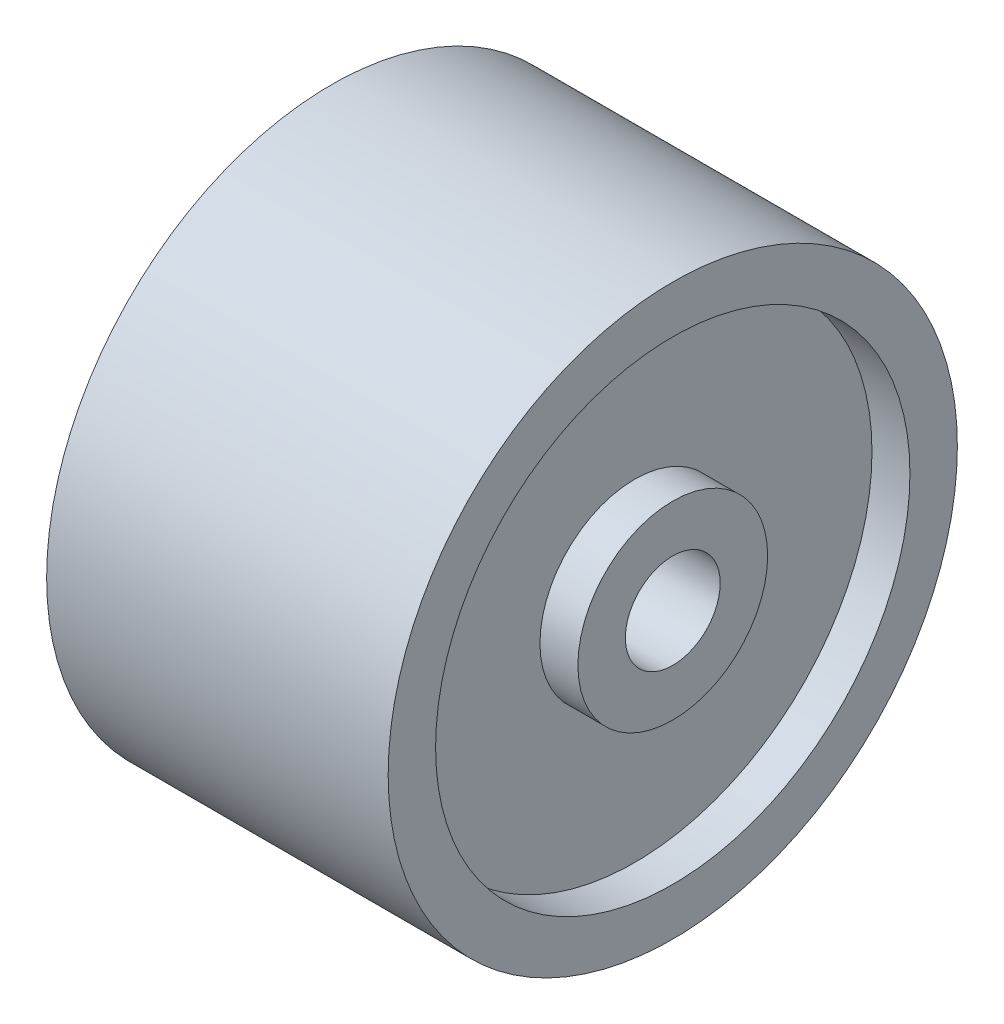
ISO-10303-21;
HEADER;
FILE_DESCRIPTION(('STEP AP214'),'2;1');
FILE_NAME('part.step','',(''),(''),'','','');
FILE_SCHEMA(('AUTOMOTIVE_DESIGN { 1 0 10303 214 1 1 1 1 }'));
ENDSEC;
DATA;
#1=APPLICATION_CONTEXT('core data for automotive mechanical design processes');
#2=APPLICATION_PROTOCOL_DEFINITION('international standard','automotive_design',2000,#1);
#3=PRODUCT_CONTEXT('',#1,'mechanical');
#4=PRODUCT('Part','Part','',(#3));
#5=PRODUCT_RELATED_PRODUCT_CATEGORY('part','',(#4));
#6=PRODUCT_DEFINITION_FORMATION('','',#4);
#7=PRODUCT_DEFINITION_CONTEXT('part definition',#1,'design');
#8=PRODUCT_DEFINITION('design','',#6,#7);
#9=PRODUCT_DEFINITION_SHAPE('','',#8);
#10=(LENGTH_UNIT() NAMED_UNIT(*) SI_UNIT(.MILLI.,.METRE.));
#11=(NAMED_UNIT(*) PLANE_ANGLE_UNIT() SI_UNIT($,.RADIAN.));
#12=(NAMED_UNIT(*) SI_UNIT($,.STERADIAN.) SOLID_ANGLE_UNIT());
#13=UNCERTAINTY_MEASURE_WITH_UNIT(LENGTH_MEASURE(1.E-05),#10,'distance_accuracy_value','');
#14=(GEOMETRIC_REPRESENTATION_CONTEXT(3) GLOBAL_UNCERTAINTY_ASSIGNED_CONTEXT((#13)) GLOBAL_UNIT_ASSIGNED_CONTEXT((#10,
#11,#12)) REPRESENTATION_CONTEXT('',''));
#15=CARTESIAN_POINT('',(0.,0.,0.));
#16=DIRECTION('',(0.,0.,1.));
#17=DIRECTION('',(1.,0.,0.));
#18=AXIS2_PLACEMENT_3D('',#15,#16,#17);
#19=CARTESIAN_POINT('',(-11.43,0.,0.));
#20=DIRECTION('',(1.,0.,0.));
#21=DIRECTION('',(0.,0.,-1.));
#22=AXIS2_PLACEMENT_3D('',#19,#20,#21);
#23=PLANE('',#22);
#24=CARTESIAN_POINT('',(-11.43,0.,0.));
#25=DIRECTION('',(1.,0.,0.));
#26=DIRECTION('',(0.,0.,-1.));
#27=AXIS2_PLACEMENT_3D('',#24,#25,#26);
#28=CIRCLE('',#27,19.05);
#29=CARTESIAN_POINT('',(-11.43,0.,-19.05));
#30=VERTEX_POINT('',#29);
#31=EDGE_CURVE('E34',#30,#30,#28,.T.);
#32=ORIENTED_EDGE('',*,*,#31,.F.);
#33=EDGE_LOOP('',(#32));
#34=FACE_BOUND('',#33,.T.);
#35=CARTESIAN_POINT('',(-11.43,0.,0.));
#36=DIRECTION('',(1.,0.,0.));
#37=DIRECTION('',(0.,0.,-1.));
#38=AXIS2_PLACEMENT_3D('',#35,#36,#37);
#39=CIRCLE('',#38,15.875);
#40=CARTESIAN_POINT('',(-11.43,0.,-15.875));
#41=VERTEX_POINT('',#40);
#42=EDGE_CURVE('E61',#41,#41,#39,.T.);
#43=ORIENTED_EDGE('',*,*,#42,.T.);
#44=EDGE_LOOP('',(#43));
#45=FACE_BOUND('',#44,.T.);
#46=ADVANCED_FACE('F30',(#34,#45),#23,.F.);
#47=CARTESIAN_POINT('',(11.43,0.,0.));
#48=DIRECTION('',(1.,0.,0.));
#49=DIRECTION('',(0.,0.,-1.));
#50=AXIS2_PLACEMENT_3D('',#47,#48,#49);
#51=PLANE('',#50);
#52=CARTESIAN_POINT('',(11.43,0.,0.));
#53=DIRECTION('',(1.,0.,0.));
#54=DIRECTION('',(0.,0.,-1.));
#55=AXIS2_PLACEMENT_3D('',#52,#53,#54);
#56=CIRCLE('',#55,3.175);
#57=CARTESIAN_POINT('',(11.43,0.,-3.175));
#58=VERTEX_POINT('',#57);
#59=EDGE_CURVE('E41',#58,#58,#56,.T.);
#60=ORIENTED_EDGE('',*,*,#59,.F.);
#61=EDGE_LOOP('',(#60));
#62=FACE_BOUND('',#61,.T.);
#63=CARTESIAN_POINT('',(11.43,0.,0.));
#64=DIRECTION('',(1.,0.,0.));
#65=DIRECTION('',(0.,0.,-1.));
#66=AXIS2_PLACEMENT_3D('',#63,#64,#65);
#67=CIRCLE('',#66,6.35);
#68=CARTESIAN_POINT('',(11.43,0.,-6.35));
#69=VERTEX_POINT('',#68);
#70=EDGE_CURVE('E55',#69,#69,#67,.T.);
#71=ORIENTED_EDGE('',*,*,#70,.T.);
#72=EDGE_LOOP('',(#71));
#73=FACE_BOUND('',#72,.T.);
#74=ADVANCED_FACE('F103',(#62,#73),#51,.T.);
#75=CARTESIAN_POINT('',(11.43,0.,0.));
#76=DIRECTION('',(1.,0.,0.));
#77=DIRECTION('',(0.,0.,-1.));
#78=AXIS2_PLACEMENT_3D('',#75,#76,#77);
#79=CIRCLE('',#78,15.875);
#80=CARTESIAN_POINT('',(11.43,0.,-15.875));
#81=VERTEX_POINT('',#80);
#82=EDGE_CURVE('E49',#81,#81,#79,.T.);
#83=ORIENTED_EDGE('',*,*,#82,.F.);
#84=EDGE_LOOP('',(#83));
#85=FACE_BOUND('',#84,.T.);
#86=CARTESIAN_POINT('',(11.43,0.,0.));
#87=DIRECTION('',(1.,0.,0.));
#88=DIRECTION('',(0.,0.,-1.));
#89=AXIS2_PLACEMENT_3D('',#86,#87,#88);
#90=CIRCLE('',#89,19.05);
#91=CARTESIAN_POINT('',(11.43,0.,-19.05));
#92=VERTEX_POINT('',#91);
#93=EDGE_CURVE('E10',#92,#92,#90,.T.);
#94=ORIENTED_EDGE('',*,*,#93,.T.);
#95=EDGE_LOOP('',(#94));
#96=FACE_BOUND('',#95,.T.);
#97=ADVANCED_FACE('F85',(#85,#96),#51,.T.);
#98=CARTESIAN_POINT('',(-11.43,0.,0.));
#99=DIRECTION('',(1.,0.,0.));
#100=DIRECTION('',(0.,0.,-1.));
#101=AXIS2_PLACEMENT_3D('',#98,#99,#100);
#102=CIRCLE('',#101,6.35);
#103=CARTESIAN_POINT('',(-11.43,0.,-6.35));
#104=VERTEX_POINT('',#103);
#105=EDGE_CURVE('E67',#104,#104,#102,.T.);
#106=ORIENTED_EDGE('',*,*,#105,.F.);
#107=EDGE_LOOP('',(#106));
#108=FACE_BOUND('',#107,.T.);
#109=CARTESIAN_POINT('',(-11.43,0.,0.));
#110=DIRECTION('',(1.,0.,0.));
#111=DIRECTION('',(0.,0.,-1.));
#112=AXIS2_PLACEMENT_3D('',#109,#110,#111);
#113=CIRCLE('',#112,3.175);
#114=CARTESIAN_POINT('',(-11.43,0.,-3.175));
#115=VERTEX_POINT('',#114);
#116=EDGE_CURVE('E43',#115,#115,#113,.T.);
#117=ORIENTED_EDGE('',*,*,#116,.T.);
#118=EDGE_LOOP('',(#117));
#119=FACE_BOUND('',#118,.T.);
#120=ADVANCED_FACE('F82',(#108,#119),#23,.F.);
#121=CARTESIAN_POINT('',(11.43,0.,0.));
#122=DIRECTION('',(-1.,0.,0.));
#123=DIRECTION('',(0.,0.,1.));
#124=AXIS2_PLACEMENT_3D('',#121,#122,#123);
#125=CYLINDRICAL_SURFACE('',#124,19.05);
#126=ORIENTED_EDGE('',*,*,#93,.F.);
#127=EDGE_LOOP('',(#126));
#128=FACE_BOUND('',#127,.T.);
#129=ORIENTED_EDGE('',*,*,#31,.T.);
#130=EDGE_LOOP('',(#129));
#131=FACE_BOUND('',#130,.T.);
#132=ADVANCED_FACE('F32',(#128,#131),#125,.T.);
#133=CARTESIAN_POINT('',(11.43,0.,0.));
#134=DIRECTION('',(-1.,0.,0.));
#135=DIRECTION('',(0.,0.,1.));
#136=AXIS2_PLACEMENT_3D('',#133,#134,#135);
#137=CYLINDRICAL_SURFACE('',#136,3.175);
#138=ORIENTED_EDGE('',*,*,#59,.T.);
#139=EDGE_LOOP('',(#138));
#140=FACE_BOUND('',#139,.T.);
#141=ORIENTED_EDGE('',*,*,#116,.F.);
#142=EDGE_LOOP('',(#141));
#143=FACE_BOUND('',#142,.T.);
#144=ADVANCED_FACE('F88',(#140,#143),#137,.F.);
#145=CARTESIAN_POINT('',(8.89,0.,0.));
#146=DIRECTION('',(1.,0.,0.));
#147=DIRECTION('',(0.,0.,-1.));
#148=AXIS2_PLACEMENT_3D('',#145,#146,#147);
#149=CYLINDRICAL_SURFACE('',#148,15.875);
#150=CARTESIAN_POINT('',(8.89,0.,0.));
#151=DIRECTION('',(1.,0.,0.));
#152=DIRECTION('',(0.,0.,-1.));
#153=AXIS2_PLACEMENT_3D('',#150,#151,#152);
#154=CIRCLE('',#153,15.875);
#155=CARTESIAN_POINT('',(8.89,0.,-15.875));
#156=VERTEX_POINT('',#155);
#157=EDGE_CURVE('E46',#156,#156,#154,.T.);
#158=ORIENTED_EDGE('',*,*,#157,.F.);
#159=EDGE_LOOP('',(#158));
#160=FACE_BOUND('',#159,.T.);
#161=ORIENTED_EDGE('',*,*,#82,.T.);
#162=EDGE_LOOP('',(#161));
#163=FACE_BOUND('',#162,.T.);
#164=ADVANCED_FACE('F90',(#160,#163),#149,.F.);
#165=CARTESIAN_POINT('',(8.89,0.,0.));
#166=DIRECTION('',(1.,0.,0.));
#167=DIRECTION('',(0.,0.,-1.));
#168=AXIS2_PLACEMENT_3D('',#165,#166,#167);
#169=PLANE('',#168);
#170=CARTESIAN_POINT('',(8.89,0.,0.));
#171=DIRECTION('',(1.,0.,0.));
#172=DIRECTION('',(0.,0.,-1.));
#173=AXIS2_PLACEMENT_3D('',#170,#171,#172);
#174=CIRCLE('',#173,6.35);
#175=CARTESIAN_POINT('',(8.89,0.,-6.35));
#176=VERTEX_POINT('',#175);
#177=EDGE_CURVE('E52',#176,#176,#174,.T.);
#178=ORIENTED_EDGE('',*,*,#177,.F.);
#179=EDGE_LOOP('',(#178));
#180=FACE_BOUND('',#179,.T.);
#181=ORIENTED_EDGE('',*,*,#157,.T.);
#182=EDGE_LOOP('',(#181));
#183=FACE_BOUND('',#182,.T.);
#184=ADVANCED_FACE('F97',(#180,#183),#169,.T.);
#185=CARTESIAN_POINT('',(8.89,0.,0.));
#186=DIRECTION('',(1.,0.,0.));
#187=DIRECTION('',(0.,0.,-1.));
#188=AXIS2_PLACEMENT_3D('',#185,#186,#187);
#189=CYLINDRICAL_SURFACE('',#188,6.35);
#190=ORIENTED_EDGE('',*,*,#177,.T.);
#191=EDGE_LOOP('',(#190));
#192=FACE_BOUND('',#191,.T.);
#193=ORIENTED_EDGE('',*,*,#70,.F.);
#194=EDGE_LOOP('',(#193));
#195=FACE_BOUND('',#194,.T.);
#196=ADVANCED_FACE('F151',(#192,#195),#189,.T.);
#197=CARTESIAN_POINT('',(-8.89,0.,0.));
#198=DIRECTION('',(-1.,0.,0.));
#199=DIRECTION('',(0.,0.,-1.));
#200=AXIS2_PLACEMENT_3D('',#197,#198,#199);
#201=PLANE('',#200);
#202=CARTESIAN_POINT('',(-8.89,0.,0.));
#203=DIRECTION('',(1.,0.,0.));
#204=DIRECTION('',(0.,0.,-1.));
#205=AXIS2_PLACEMENT_3D('',#202,#203,#204);
#206=CIRCLE('',#205,15.875);
#207=CARTESIAN_POINT('',(-8.89,0.,-15.875));
#208=VERTEX_POINT('',#207);
#209=EDGE_CURVE('E58',#208,#208,#206,.T.);
#210=ORIENTED_EDGE('',*,*,#209,.F.);
#211=EDGE_LOOP('',(#210));
#212=FACE_BOUND('',#211,.T.);
#213=CARTESIAN_POINT('',(-8.89,0.,0.));
#214=DIRECTION('',(1.,0.,0.));
#215=DIRECTION('',(0.,0.,-1.));
#216=AXIS2_PLACEMENT_3D('',#213,#214,#215);
#217=CIRCLE('',#216,6.35);
#218=CARTESIAN_POINT('',(-8.89,0.,-6.35));
#219=VERTEX_POINT('',#218);
#220=EDGE_CURVE('E64',#219,#219,#217,.T.);
#221=ORIENTED_EDGE('',*,*,#220,.T.);
#222=EDGE_LOOP('',(#221));
#223=FACE_BOUND('',#222,.T.);
#224=ADVANCED_FACE('F73',(#212,#223),#201,.T.);
#225=CARTESIAN_POINT('',(-8.89,0.,0.));
#226=DIRECTION('',(-1.,0.,0.));
#227=DIRECTION('',(0.,0.,1.));
#228=AXIS2_PLACEMENT_3D('',#225,#226,#227);
#229=CYLINDRICAL_SURFACE('',#228,15.875);
#230=ORIENTED_EDGE('',*,*,#209,.T.);
#231=EDGE_LOOP('',(#230));
#232=FACE_BOUND('',#231,.T.);
#233=ORIENTED_EDGE('',*,*,#42,.F.);
#234=EDGE_LOOP('',(#233));
#235=FACE_BOUND('',#234,.T.);
#236=ADVANCED_FACE('F78',(#232,#235),#229,.F.);
#237=CARTESIAN_POINT('',(-8.89,0.,0.));
#238=DIRECTION('',(-1.,0.,0.));
#239=DIRECTION('',(0.,0.,1.));
#240=AXIS2_PLACEMENT_3D('',#237,#238,#239);
#241=CYLINDRICAL_SURFACE('',#240,6.35);
#242=ORIENTED_EDGE('',*,*,#220,.F.);
#243=EDGE_LOOP('',(#242));
#244=FACE_BOUND('',#243,.T.);
#245=ORIENTED_EDGE('',*,*,#105,.T.);
#246=EDGE_LOOP('',(#245));
#247=FACE_BOUND('',#246,.T.);
#248=ADVANCED_FACE('F75',(#244,#247),#241,.T.);
#249=CLOSED_SHELL('',(#46,#74,#97,#120,#132,#144,#164,#184,#196,#224,#236,#248));
#250=MANIFOLD_SOLID_BREP('B2',#249);
#251=ADVANCED_BREP_SHAPE_REPRESENTATION('',(#18,#250),#14);
#252=SHAPE_DEFINITION_REPRESENTATION(#9,#251);
ENDSEC;
END-ISO-10303-21;
